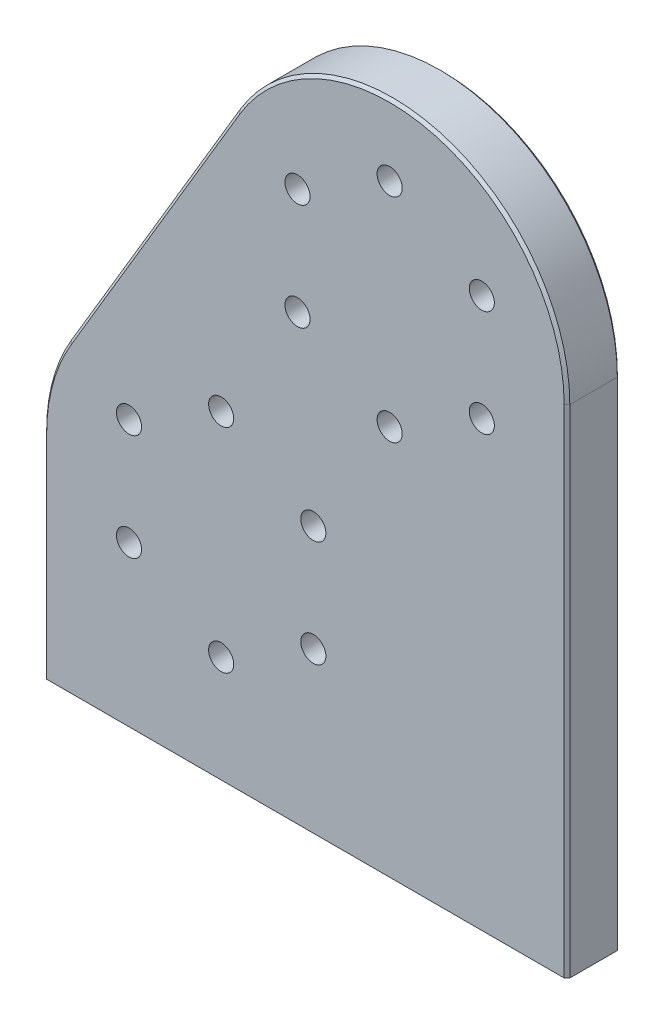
ISO-10303-21;
HEADER;
FILE_DESCRIPTION(('STEP AP214'),'2;1');
FILE_NAME('part.step','',(''),(''),'','','');
FILE_SCHEMA(('AUTOMOTIVE_DESIGN { 1 0 10303 214 1 1 1 1 }'));
ENDSEC;
DATA;
#1=APPLICATION_CONTEXT('core data for automotive mechanical design processes');
#2=APPLICATION_PROTOCOL_DEFINITION('international standard','automotive_design',2000,#1);
#3=PRODUCT_CONTEXT('',#1,'mechanical');
#4=PRODUCT('Part','Part','',(#3));
#5=PRODUCT_RELATED_PRODUCT_CATEGORY('part','',(#4));
#6=PRODUCT_DEFINITION_FORMATION('','',#4);
#7=PRODUCT_DEFINITION_CONTEXT('part definition',#1,'design');
#8=PRODUCT_DEFINITION('design','',#6,#7);
#9=PRODUCT_DEFINITION_SHAPE('','',#8);
#10=(LENGTH_UNIT() NAMED_UNIT(*) SI_UNIT(.MILLI.,.METRE.));
#11=(NAMED_UNIT(*) PLANE_ANGLE_UNIT() SI_UNIT($,.RADIAN.));
#12=(NAMED_UNIT(*) SI_UNIT($,.STERADIAN.) SOLID_ANGLE_UNIT());
#13=UNCERTAINTY_MEASURE_WITH_UNIT(LENGTH_MEASURE(1.E-05),#10,'distance_accuracy_value','');
#14=(GEOMETRIC_REPRESENTATION_CONTEXT(3) GLOBAL_UNCERTAINTY_ASSIGNED_CONTEXT((#13)) GLOBAL_UNIT_ASSIGNED_CONTEXT((#10,
#11,#12)) REPRESENTATION_CONTEXT('',''));
#15=CARTESIAN_POINT('',(0.,0.,0.));
#16=DIRECTION('',(0.,0.,1.));
#17=DIRECTION('',(1.,0.,0.));
#18=AXIS2_PLACEMENT_3D('',#15,#16,#17);
#19=CARTESIAN_POINT('',(30.1625,88.9,4.7625));
#20=DIRECTION('',(0.,0.,-1.));
#21=DIRECTION('',(-1.,0.,0.));
#22=AXIS2_PLACEMENT_3D('',#19,#20,#21);
#23=CYLINDRICAL_SURFACE('',#22,31.75);
#24=DIRECTION('',(0.,0.,-1.));
#25=VECTOR('',#24,1.);
#26=CARTESIAN_POINT('',(2.86211188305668,105.109605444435,4.7625));
#27=LINE('',#26,#25);
#28=CARTESIAN_POINT('',(2.86211188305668,105.109605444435,4.25449999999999));
#29=VERTEX_POINT('',#28);
#30=CARTESIAN_POINT('',(2.86211188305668,105.109605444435,-4.2545));
#31=VERTEX_POINT('',#30);
#32=EDGE_CURVE('E187',#29,#31,#27,.T.);
#33=ORIENTED_EDGE('',*,*,#32,.F.);
#34=CARTESIAN_POINT('',(30.1625,88.9,4.25449999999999));
#35=DIRECTION('',(0.,0.,1.));
#36=DIRECTION('',(1.,0.,0.));
#37=AXIS2_PLACEMENT_3D('',#34,#35,#36);
#38=CIRCLE('',#37,31.75);
#39=CARTESIAN_POINT('',(61.9125,88.9,4.25449999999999));
#40=VERTEX_POINT('',#39);
#41=EDGE_CURVE('E216',#29,#40,#38,.F.);
#42=ORIENTED_EDGE('',*,*,#41,.T.);
#43=DIRECTION('',(0.,0.,-1.));
#44=VECTOR('',#43,1.);
#45=CARTESIAN_POINT('',(61.9125,88.9,4.7625));
#46=LINE('',#45,#44);
#47=CARTESIAN_POINT('',(61.9125,88.9,-4.2545));
#48=VERTEX_POINT('',#47);
#49=EDGE_CURVE('E172',#40,#48,#46,.T.);
#50=ORIENTED_EDGE('',*,*,#49,.T.);
#51=CARTESIAN_POINT('',(30.1625,88.9,-4.25450000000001));
#52=DIRECTION('',(0.,0.,1.));
#53=DIRECTION('',(1.,0.,0.));
#54=AXIS2_PLACEMENT_3D('',#51,#52,#53);
#55=CIRCLE('',#54,31.75);
#56=EDGE_CURVE('E214',#48,#31,#55,.T.);
#57=ORIENTED_EDGE('',*,*,#56,.T.);
#58=EDGE_LOOP('',(#33,#42,#50,#57));
#59=FACE_BOUND('',#58,.T.);
#60=ADVANCED_FACE('F36',(#59),#23,.T.);
#61=CARTESIAN_POINT('',(-27.3003881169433,54.3096054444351,4.7625));
#62=DIRECTION('',(0.859854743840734,-0.510538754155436,0.));
#63=DIRECTION('',(0.510538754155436,0.859854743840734,0.));
#64=AXIS2_PLACEMENT_3D('',#61,#62,#63);
#65=PLANE('',#64);
#66=DIRECTION('',(0.,0.,-1.));
#67=VECTOR('',#66,1.);
#68=CARTESIAN_POINT('',(-27.3003881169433,54.3096054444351,4.7625));
#69=LINE('',#68,#67);
#70=CARTESIAN_POINT('',(-27.3003881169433,54.3096054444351,4.25449999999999));
#71=VERTEX_POINT('',#70);
#72=CARTESIAN_POINT('',(-27.3003881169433,54.3096054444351,-4.2545));
#73=VERTEX_POINT('',#72);
#74=EDGE_CURVE('E184',#71,#73,#69,.T.);
#75=ORIENTED_EDGE('',*,*,#74,.F.);
#76=DIRECTION('',(0.510538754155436,0.859854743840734,0.));
#77=VECTOR('',#76,1.);
#78=CARTESIAN_POINT('',(2.86211188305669,105.109605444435,4.25449999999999));
#79=LINE('',#78,#77);
#80=EDGE_CURVE('E220',#71,#29,#79,.T.);
#81=ORIENTED_EDGE('',*,*,#80,.T.);
#82=ORIENTED_EDGE('',*,*,#32,.T.);
#83=DIRECTION('',(-0.510538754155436,-0.859854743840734,0.));
#84=VECTOR('',#83,1.);
#85=CARTESIAN_POINT('',(-27.3003881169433,54.3096054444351,-4.25450000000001));
#86=LINE('',#85,#84);
#87=EDGE_CURVE('E218',#31,#73,#86,.T.);
#88=ORIENTED_EDGE('',*,*,#87,.T.);
#89=EDGE_LOOP('',(#75,#81,#82,#88));
#90=FACE_BOUND('',#89,.T.);
#91=ADVANCED_FACE('F288',(#90),#65,.F.);
#92=CARTESIAN_POINT('',(0.,38.1,4.7625));
#93=DIRECTION('',(0.,0.,-1.));
#94=DIRECTION('',(-1.,0.,0.));
#95=AXIS2_PLACEMENT_3D('',#92,#93,#94);
#96=CYLINDRICAL_SURFACE('',#95,31.75);
#97=DIRECTION('',(0.,0.,-1.));
#98=VECTOR('',#97,1.);
#99=CARTESIAN_POINT('',(-31.75,38.1,4.7625));
#100=LINE('',#99,#98);
#101=CARTESIAN_POINT('',(-31.75,38.1,4.25449999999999));
#102=VERTEX_POINT('',#101);
#103=CARTESIAN_POINT('',(-31.75,38.1,-4.2545));
#104=VERTEX_POINT('',#103);
#105=EDGE_CURVE('E181',#102,#104,#100,.T.);
#106=ORIENTED_EDGE('',*,*,#105,.F.);
#107=CARTESIAN_POINT('',(0.,38.1,4.25449999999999));
#108=DIRECTION('',(0.,0.,1.));
#109=DIRECTION('',(1.,0.,0.));
#110=AXIS2_PLACEMENT_3D('',#107,#108,#109);
#111=CIRCLE('',#110,31.75);
#112=EDGE_CURVE('E224',#102,#71,#111,.F.);
#113=ORIENTED_EDGE('',*,*,#112,.T.);
#114=ORIENTED_EDGE('',*,*,#74,.T.);
#115=CARTESIAN_POINT('',(0.,38.1,-4.25450000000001));
#116=DIRECTION('',(0.,0.,1.));
#117=DIRECTION('',(1.,0.,0.));
#118=AXIS2_PLACEMENT_3D('',#115,#116,#117);
#119=CIRCLE('',#118,31.75);
#120=EDGE_CURVE('E222',#73,#104,#119,.T.);
#121=ORIENTED_EDGE('',*,*,#120,.T.);
#122=EDGE_LOOP('',(#106,#113,#114,#121));
#123=FACE_BOUND('',#122,.T.);
#124=ADVANCED_FACE('F284',(#123),#96,.T.);
#125=CARTESIAN_POINT('',(-31.75,38.1,4.7625));
#126=DIRECTION('',(1.,0.,0.));
#127=DIRECTION('',(0.,0.,-1.));
#128=AXIS2_PLACEMENT_3D('',#125,#126,#127);
#129=PLANE('',#128);
#130=DIRECTION('',(0.,0.,-1.));
#131=VECTOR('',#130,1.);
#132=CARTESIAN_POINT('',(-31.75,0.,4.7625));
#133=LINE('',#132,#131);
#134=CARTESIAN_POINT('',(-31.75,0.,4.25449999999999));
#135=VERTEX_POINT('',#134);
#136=CARTESIAN_POINT('',(-31.75,0.,-4.25450000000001));
#137=VERTEX_POINT('',#136);
#138=EDGE_CURVE('E178',#135,#137,#133,.T.);
#139=ORIENTED_EDGE('',*,*,#138,.F.);
#140=DIRECTION('',(0.,1.,0.));
#141=VECTOR('',#140,1.);
#142=CARTESIAN_POINT('',(-31.75,38.1,4.25449999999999));
#143=LINE('',#142,#141);
#144=EDGE_CURVE('E228',#135,#102,#143,.T.);
#145=ORIENTED_EDGE('',*,*,#144,.T.);
#146=ORIENTED_EDGE('',*,*,#105,.T.);
#147=DIRECTION('',(0.,-1.,0.));
#148=VECTOR('',#147,1.);
#149=CARTESIAN_POINT('',(-31.75,38.1,-4.25450000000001));
#150=LINE('',#149,#148);
#151=EDGE_CURVE('E226',#104,#137,#150,.T.);
#152=ORIENTED_EDGE('',*,*,#151,.T.);
#153=EDGE_LOOP('',(#139,#145,#146,#152));
#154=FACE_BOUND('',#153,.T.);
#155=ADVANCED_FACE('F269',(#154),#129,.F.);
#156=CARTESIAN_POINT('',(-31.75,0.,4.7625));
#157=DIRECTION('',(0.,1.,0.));
#158=DIRECTION('',(0.,0.,1.));
#159=AXIS2_PLACEMENT_3D('',#156,#157,#158);
#160=PLANE('',#159);
#161=CARTESIAN_POINT('',(50.8,0.,0.));
#162=DIRECTION('',(0.,-1.,0.));
#163=DIRECTION('',(0.,0.,-1.));
#164=AXIS2_PLACEMENT_3D('',#161,#162,#163);
#165=CIRCLE('',#164,2.38125);
#166=CARTESIAN_POINT('',(50.8,0.,-2.38125));
#167=VERTEX_POINT('',#166);
#168=EDGE_CURVE('E247',#167,#167,#165,.T.);
#169=ORIENTED_EDGE('',*,*,#168,.F.);
#170=EDGE_LOOP('',(#169));
#171=FACE_BOUND('',#170,.T.);
#172=CARTESIAN_POINT('',(0.,0.,0.));
#173=DIRECTION('',(0.,-1.,0.));
#174=DIRECTION('',(0.,0.,-1.));
#175=AXIS2_PLACEMENT_3D('',#172,#173,#174);
#176=CIRCLE('',#175,2.38125);
#177=CARTESIAN_POINT('',(0.,0.,-2.38125));
#178=VERTEX_POINT('',#177);
#179=EDGE_CURVE('E625',#178,#178,#176,.T.);
#180=ORIENTED_EDGE('',*,*,#179,.F.);
#181=EDGE_LOOP('',(#180));
#182=FACE_BOUND('',#181,.T.);
#183=CARTESIAN_POINT('',(25.4,0.,0.));
#184=DIRECTION('',(0.,-1.,0.));
#185=DIRECTION('',(0.,0.,-1.));
#186=AXIS2_PLACEMENT_3D('',#183,#184,#185);
#187=CIRCLE('',#186,2.0828);
#188=CARTESIAN_POINT('',(25.4,0.,-2.0828));
#189=VERTEX_POINT('',#188);
#190=EDGE_CURVE('E151',#189,#189,#187,.T.);
#191=ORIENTED_EDGE('',*,*,#190,.F.);
#192=EDGE_LOOP('',(#191));
#193=FACE_BOUND('',#192,.T.);
#194=CARTESIAN_POINT('',(-25.4,0.,0.));
#195=DIRECTION('',(0.,-1.,0.));
#196=DIRECTION('',(0.,0.,-1.));
#197=AXIS2_PLACEMENT_3D('',#194,#195,#196);
#198=CIRCLE('',#197,2.0828);
#199=CARTESIAN_POINT('',(-25.4,0.,-2.0828));
#200=VERTEX_POINT('',#199);
#201=EDGE_CURVE('E163',#200,#200,#198,.T.);
#202=ORIENTED_EDGE('',*,*,#201,.F.);
#203=EDGE_LOOP('',(#202));
#204=FACE_BOUND('',#203,.T.);
#205=DIRECTION('',(0.,0.,-1.));
#206=VECTOR('',#205,1.);
#207=CARTESIAN_POINT('',(61.9125,0.,4.7625));
#208=LINE('',#207,#206);
#209=CARTESIAN_POINT('',(61.9125,0.,4.25449999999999));
#210=VERTEX_POINT('',#209);
#211=CARTESIAN_POINT('',(61.9125,0.,-4.2545));
#212=VERTEX_POINT('',#211);
#213=EDGE_CURVE('E175',#210,#212,#208,.T.);
#214=ORIENTED_EDGE('',*,*,#213,.F.);
#215=DIRECTION('',(-0.707106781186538,0.,0.707106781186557));
#216=VECTOR('',#215,1.);
#217=CARTESIAN_POINT('',(61.4045,0.,4.76250000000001));
#218=LINE('',#217,#216);
#219=CARTESIAN_POINT('',(61.4045,0.,4.7625));
#220=VERTEX_POINT('',#219);
#221=EDGE_CURVE('E212',#210,#220,#218,.T.);
#222=ORIENTED_EDGE('',*,*,#221,.T.);
#223=DIRECTION('',(1.,0.,0.));
#224=VECTOR('',#223,1.);
#225=CARTESIAN_POINT('',(-31.75,0.,4.7625));
#226=LINE('',#225,#224);
#227=CARTESIAN_POINT('',(-31.242,0.,4.7625));
#228=VERTEX_POINT('',#227);
#229=EDGE_CURVE('E169',#228,#220,#226,.T.);
#230=ORIENTED_EDGE('',*,*,#229,.F.);
#231=DIRECTION('',(-0.707106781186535,0.,-0.70710678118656));
#232=VECTOR('',#231,1.);
#233=CARTESIAN_POINT('',(-31.242,0.,4.7625));
#234=LINE('',#233,#232);
#235=EDGE_CURVE('E210',#228,#135,#234,.T.);
#236=ORIENTED_EDGE('',*,*,#235,.T.);
#237=ORIENTED_EDGE('',*,*,#138,.T.);
#238=DIRECTION('',(-0.707106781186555,0.,0.70710678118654));
#239=VECTOR('',#238,1.);
#240=CARTESIAN_POINT('',(-31.75,0.,-4.25450000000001));
#241=LINE('',#240,#239);
#242=CARTESIAN_POINT('',(-31.242,0.,-4.7625));
#243=VERTEX_POINT('',#242);
#244=EDGE_CURVE('E206',#137,#243,#241,.F.);
#245=ORIENTED_EDGE('',*,*,#244,.T.);
#246=DIRECTION('',(1.,0.,0.));
#247=VECTOR('',#246,1.);
#248=CARTESIAN_POINT('',(-31.75,0.,-4.7625));
#249=LINE('',#248,#247);
#250=CARTESIAN_POINT('',(61.4045,0.,-4.76250000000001));
#251=VERTEX_POINT('',#250);
#252=EDGE_CURVE('E166',#243,#251,#249,.T.);
#253=ORIENTED_EDGE('',*,*,#252,.T.);
#254=DIRECTION('',(-0.707106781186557,0.,-0.707106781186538));
#255=VECTOR('',#254,1.);
#256=CARTESIAN_POINT('',(61.9125,0.,-4.25450000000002));
#257=LINE('',#256,#255);
#258=EDGE_CURVE('E208',#251,#212,#257,.F.);
#259=ORIENTED_EDGE('',*,*,#258,.T.);
#260=EDGE_LOOP('',(#214,#222,#230,#236,#237,#245,#253,#259));
#261=FACE_BOUND('',#260,.T.);
#262=ADVANCED_FACE('F274',(#171,#182,#193,#204,#261),#160,.F.);
#263=CARTESIAN_POINT('',(61.9125,88.9,4.7625));
#264=DIRECTION('',(-1.,0.,0.));
#265=DIRECTION('',(0.,-1.,0.));
#266=AXIS2_PLACEMENT_3D('',#263,#264,#265);
#267=PLANE('',#266);
#268=ORIENTED_EDGE('',*,*,#49,.F.);
#269=DIRECTION('',(0.,-1.,0.));
#270=VECTOR('',#269,1.);
#271=CARTESIAN_POINT('',(61.9125,0.,4.25449999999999));
#272=LINE('',#271,#270);
#273=EDGE_CURVE('E204',#40,#210,#272,.T.);
#274=ORIENTED_EDGE('',*,*,#273,.T.);
#275=ORIENTED_EDGE('',*,*,#213,.T.);
#276=DIRECTION('',(0.,1.,0.));
#277=VECTOR('',#276,1.);
#278=CARTESIAN_POINT('',(61.9125,88.9,-4.25450000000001));
#279=LINE('',#278,#277);
#280=EDGE_CURVE('E201',#212,#48,#279,.T.);
#281=ORIENTED_EDGE('',*,*,#280,.T.);
#282=EDGE_LOOP('',(#268,#274,#275,#281));
#283=FACE_BOUND('',#282,.T.);
#284=ADVANCED_FACE('F307',(#283),#267,.F.);
#285=CARTESIAN_POINT('',(30.1625,88.9,4.7625));
#286=DIRECTION('',(0.,0.,1.));
#287=DIRECTION('',(1.,0.,0.));
#288=AXIS2_PLACEMENT_3D('',#285,#286,#287);
#289=PLANE('',#288);
#290=CARTESIAN_POINT('',(30.1625,69.85,4.7625));
#291=DIRECTION('',(0.,0.,1.));
#292=DIRECTION('',(1.,0.,0.));
#293=AXIS2_PLACEMENT_3D('',#290,#291,#292);
#294=CIRCLE('',#293,2.24789999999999);
#295=CARTESIAN_POINT('',(32.4104,69.85,4.7625));
#296=VERTEX_POINT('',#295);
#297=EDGE_CURVE('E644',#296,#296,#294,.T.);
#298=ORIENTED_EDGE('',*,*,#297,.F.);
#299=EDGE_LOOP('',(#298));
#300=FACE_BOUND('',#299,.T.);
#301=CARTESIAN_POINT('',(13.6647160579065,79.375,4.7625));
#302=DIRECTION('',(0.,0.,1.));
#303=DIRECTION('',(1.,0.,0.));
#304=AXIS2_PLACEMENT_3D('',#301,#302,#303);
#305=CIRCLE('',#304,2.24789999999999);
#306=CARTESIAN_POINT('',(15.9126160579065,79.375,4.7625));
#307=VERTEX_POINT('',#306);
#308=EDGE_CURVE('E650',#307,#307,#305,.T.);
#309=ORIENTED_EDGE('',*,*,#308,.F.);
#310=EDGE_LOOP('',(#309));
#311=FACE_BOUND('',#310,.T.);
#312=CARTESIAN_POINT('',(46.6602839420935,98.425,4.7625));
#313=DIRECTION('',(0.,0.,1.));
#314=DIRECTION('',(1.,0.,0.));
#315=AXIS2_PLACEMENT_3D('',#312,#313,#314);
#316=CIRCLE('',#315,2.24789999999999);
#317=CARTESIAN_POINT('',(48.9081839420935,98.425,4.7625));
#318=VERTEX_POINT('',#317);
#319=EDGE_CURVE('E656',#318,#318,#316,.T.);
#320=ORIENTED_EDGE('',*,*,#319,.F.);
#321=EDGE_LOOP('',(#320));
#322=FACE_BOUND('',#321,.T.);
#323=CARTESIAN_POINT('',(30.1625,107.95,4.7625));
#324=DIRECTION('',(0.,0.,1.));
#325=DIRECTION('',(1.,0.,0.));
#326=AXIS2_PLACEMENT_3D('',#323,#324,#325);
#327=CIRCLE('',#326,2.24789999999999);
#328=CARTESIAN_POINT('',(32.4104,107.95,4.7625));
#329=VERTEX_POINT('',#328);
#330=EDGE_CURVE('E662',#329,#329,#327,.T.);
#331=ORIENTED_EDGE('',*,*,#330,.F.);
#332=EDGE_LOOP('',(#331));
#333=FACE_BOUND('',#332,.T.);
#334=CARTESIAN_POINT('',(13.6647160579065,98.425,4.7625));
#335=DIRECTION('',(0.,0.,1.));
#336=DIRECTION('',(1.,0.,0.));
#337=AXIS2_PLACEMENT_3D('',#334,#335,#336);
#338=CIRCLE('',#337,2.24789999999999);
#339=CARTESIAN_POINT('',(15.9126160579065,98.425,4.7625));
#340=VERTEX_POINT('',#339);
#341=EDGE_CURVE('E668',#340,#340,#338,.T.);
#342=ORIENTED_EDGE('',*,*,#341,.F.);
#343=EDGE_LOOP('',(#342));
#344=FACE_BOUND('',#343,.T.);
#345=CARTESIAN_POINT('',(46.6602839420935,79.375,4.7625));
#346=DIRECTION('',(0.,0.,1.));
#347=DIRECTION('',(1.,0.,0.));
#348=AXIS2_PLACEMENT_3D('',#345,#346,#347);
#349=CIRCLE('',#348,2.24789999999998);
#350=CARTESIAN_POINT('',(48.9081839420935,79.375,4.7625));
#351=VERTEX_POINT('',#350);
#352=EDGE_CURVE('E674',#351,#351,#349,.T.);
#353=ORIENTED_EDGE('',*,*,#352,.F.);
#354=EDGE_LOOP('',(#353));
#355=FACE_BOUND('',#354,.T.);
#356=CARTESIAN_POINT('',(16.4977839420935,47.625,4.7625));
#357=DIRECTION('',(0.,0.,1.));
#358=DIRECTION('',(1.,0.,0.));
#359=AXIS2_PLACEMENT_3D('',#356,#357,#358);
#360=CIRCLE('',#359,2.24789999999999);
#361=CARTESIAN_POINT('',(18.7456839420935,47.625,4.7625));
#362=VERTEX_POINT('',#361);
#363=EDGE_CURVE('E680',#362,#362,#360,.T.);
#364=ORIENTED_EDGE('',*,*,#363,.F.);
#365=EDGE_LOOP('',(#364));
#366=FACE_BOUND('',#365,.T.);
#367=CARTESIAN_POINT('',(16.4977839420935,28.575,4.7625));
#368=DIRECTION('',(0.,0.,1.));
#369=DIRECTION('',(1.,0.,0.));
#370=AXIS2_PLACEMENT_3D('',#367,#368,#369);
#371=CIRCLE('',#370,2.24789999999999);
#372=CARTESIAN_POINT('',(18.7456839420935,28.575,4.7625));
#373=VERTEX_POINT('',#372);
#374=EDGE_CURVE('E686',#373,#373,#371,.T.);
#375=ORIENTED_EDGE('',*,*,#374,.F.);
#376=EDGE_LOOP('',(#375));
#377=FACE_BOUND('',#376,.T.);
#378=CARTESIAN_POINT('',(0.,57.15,4.7625));
#379=DIRECTION('',(0.,0.,1.));
#380=DIRECTION('',(1.,0.,0.));
#381=AXIS2_PLACEMENT_3D('',#378,#379,#380);
#382=CIRCLE('',#381,2.24789999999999);
#383=CARTESIAN_POINT('',(2.24789999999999,57.15,4.7625));
#384=VERTEX_POINT('',#383);
#385=EDGE_CURVE('E692',#384,#384,#382,.T.);
#386=ORIENTED_EDGE('',*,*,#385,.F.);
#387=EDGE_LOOP('',(#386));
#388=FACE_BOUND('',#387,.T.);
#389=CARTESIAN_POINT('',(-16.4977839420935,28.575,4.7625));
#390=DIRECTION('',(0.,0.,1.));
#391=DIRECTION('',(1.,0.,0.));
#392=AXIS2_PLACEMENT_3D('',#389,#390,#391);
#393=CIRCLE('',#392,2.24789999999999);
#394=CARTESIAN_POINT('',(-14.2498839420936,28.575,4.7625));
#395=VERTEX_POINT('',#394);
#396=EDGE_CURVE('E698',#395,#395,#393,.T.);
#397=ORIENTED_EDGE('',*,*,#396,.F.);
#398=EDGE_LOOP('',(#397));
#399=FACE_BOUND('',#398,.T.);
#400=CARTESIAN_POINT('',(-16.4977839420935,47.625,4.7625));
#401=DIRECTION('',(0.,0.,1.));
#402=DIRECTION('',(1.,0.,0.));
#403=AXIS2_PLACEMENT_3D('',#400,#401,#402);
#404=CIRCLE('',#403,2.24789999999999);
#405=CARTESIAN_POINT('',(-14.2498839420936,47.625,4.7625));
#406=VERTEX_POINT('',#405);
#407=EDGE_CURVE('E704',#406,#406,#404,.T.);
#408=ORIENTED_EDGE('',*,*,#407,.F.);
#409=EDGE_LOOP('',(#408));
#410=FACE_BOUND('',#409,.T.);
#411=CARTESIAN_POINT('',(0.,19.05,4.7625));
#412=DIRECTION('',(0.,0.,1.));
#413=DIRECTION('',(1.,0.,0.));
#414=AXIS2_PLACEMENT_3D('',#411,#412,#413);
#415=CIRCLE('',#414,2.24789999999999);
#416=CARTESIAN_POINT('',(2.24789999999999,19.05,4.7625));
#417=VERTEX_POINT('',#416);
#418=EDGE_CURVE('E139',#417,#417,#415,.T.);
#419=ORIENTED_EDGE('',*,*,#418,.F.);
#420=EDGE_LOOP('',(#419));
#421=FACE_BOUND('',#420,.T.);
#422=ORIENTED_EDGE('',*,*,#229,.T.);
#423=DIRECTION('',(0.,1.,0.));
#424=VECTOR('',#423,1.);
#425=CARTESIAN_POINT('',(61.4045,88.9,4.7625));
#426=LINE('',#425,#424);
#427=CARTESIAN_POINT('',(61.4045,88.9,4.7625));
#428=VERTEX_POINT('',#427);
#429=EDGE_CURVE('E198',#220,#428,#426,.T.);
#430=ORIENTED_EDGE('',*,*,#429,.T.);
#431=CARTESIAN_POINT('',(30.1625,88.9,4.7625));
#432=DIRECTION('',(0.,0.,1.));
#433=DIRECTION('',(1.,0.,0.));
#434=AXIS2_PLACEMENT_3D('',#431,#432,#433);
#435=CIRCLE('',#434,31.242);
#436=CARTESIAN_POINT('',(3.29891809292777,104.850251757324,4.7625));
#437=VERTEX_POINT('',#436);
#438=EDGE_CURVE('E196',#428,#437,#435,.T.);
#439=ORIENTED_EDGE('',*,*,#438,.T.);
#440=DIRECTION('',(-0.510538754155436,-0.859854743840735,0.));
#441=VECTOR('',#440,1.);
#442=CARTESIAN_POINT('',(-26.8635819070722,54.0502517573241,4.7625));
#443=LINE('',#442,#441);
#444=CARTESIAN_POINT('',(-26.8635819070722,54.0502517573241,4.7625));
#445=VERTEX_POINT('',#444);
#446=EDGE_CURVE('E194',#437,#445,#443,.T.);
#447=ORIENTED_EDGE('',*,*,#446,.T.);
#448=CARTESIAN_POINT('',(0.,38.1,4.7625));
#449=DIRECTION('',(0.,0.,1.));
#450=DIRECTION('',(1.,0.,0.));
#451=AXIS2_PLACEMENT_3D('',#448,#449,#450);
#452=CIRCLE('',#451,31.242);
#453=CARTESIAN_POINT('',(-31.242,38.1,4.7625));
#454=VERTEX_POINT('',#453);
#455=EDGE_CURVE('E192',#445,#454,#452,.T.);
#456=ORIENTED_EDGE('',*,*,#455,.T.);
#457=DIRECTION('',(0.,-1.,0.));
#458=VECTOR('',#457,1.);
#459=CARTESIAN_POINT('',(-31.242,0.,4.7625));
#460=LINE('',#459,#458);
#461=EDGE_CURVE('E190',#454,#228,#460,.T.);
#462=ORIENTED_EDGE('',*,*,#461,.T.);
#463=EDGE_LOOP('',(#422,#430,#439,#447,#456,#462));
#464=FACE_BOUND('',#463,.T.);
#465=ADVANCED_FACE('F314',(#300,#311,#322,#333,#344,#355,#366,#377,#388,#399,#410,#421,#464),
#289,.T.);
#466=CARTESIAN_POINT('',(30.1625,88.9,-4.7625));
#467=DIRECTION('',(0.,0.,1.));
#468=DIRECTION('',(1.,0.,0.));
#469=AXIS2_PLACEMENT_3D('',#466,#467,#468);
#470=PLANE('',#469);
#471=CARTESIAN_POINT('',(30.1625,69.85,-4.7625));
#472=DIRECTION('',(0.,0.,1.));
#473=DIRECTION('',(1.,0.,0.));
#474=AXIS2_PLACEMENT_3D('',#471,#472,#473);
#475=CIRCLE('',#474,2.2479);
#476=CARTESIAN_POINT('',(32.4104,69.85,-4.7625));
#477=VERTEX_POINT('',#476);
#478=EDGE_CURVE('E636',#477,#477,#475,.T.);
#479=ORIENTED_EDGE('',*,*,#478,.T.);
#480=EDGE_LOOP('',(#479));
#481=FACE_BOUND('',#480,.T.);
#482=CARTESIAN_POINT('',(13.6647160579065,79.375,-4.7625));
#483=DIRECTION('',(0.,0.,1.));
#484=DIRECTION('',(1.,0.,0.));
#485=AXIS2_PLACEMENT_3D('',#482,#483,#484);
#486=CIRCLE('',#485,2.2479);
#487=CARTESIAN_POINT('',(15.9126160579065,79.375,-4.7625));
#488=VERTEX_POINT('',#487);
#489=EDGE_CURVE('E647',#488,#488,#486,.T.);
#490=ORIENTED_EDGE('',*,*,#489,.T.);
#491=EDGE_LOOP('',(#490));
#492=FACE_BOUND('',#491,.T.);
#493=CARTESIAN_POINT('',(46.6602839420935,98.425,-4.7625));
#494=DIRECTION('',(0.,0.,1.));
#495=DIRECTION('',(1.,0.,0.));
#496=AXIS2_PLACEMENT_3D('',#493,#494,#495);
#497=CIRCLE('',#496,2.2479);
#498=CARTESIAN_POINT('',(48.9081839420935,98.425,-4.7625));
#499=VERTEX_POINT('',#498);
#500=EDGE_CURVE('E653',#499,#499,#497,.T.);
#501=ORIENTED_EDGE('',*,*,#500,.T.);
#502=EDGE_LOOP('',(#501));
#503=FACE_BOUND('',#502,.T.);
#504=CARTESIAN_POINT('',(30.1625,107.95,-4.7625));
#505=DIRECTION('',(0.,0.,1.));
#506=DIRECTION('',(1.,0.,0.));
#507=AXIS2_PLACEMENT_3D('',#504,#505,#506);
#508=CIRCLE('',#507,2.2479);
#509=CARTESIAN_POINT('',(32.4104,107.95,-4.7625));
#510=VERTEX_POINT('',#509);
#511=EDGE_CURVE('E659',#510,#510,#508,.T.);
#512=ORIENTED_EDGE('',*,*,#511,.T.);
#513=EDGE_LOOP('',(#512));
#514=FACE_BOUND('',#513,.T.);
#515=CARTESIAN_POINT('',(13.6647160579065,98.425,-4.7625));
#516=DIRECTION('',(0.,0.,1.));
#517=DIRECTION('',(1.,0.,0.));
#518=AXIS2_PLACEMENT_3D('',#515,#516,#517);
#519=CIRCLE('',#518,2.2479);
#520=CARTESIAN_POINT('',(15.9126160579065,98.425,-4.7625));
#521=VERTEX_POINT('',#520);
#522=EDGE_CURVE('E665',#521,#521,#519,.T.);
#523=ORIENTED_EDGE('',*,*,#522,.T.);
#524=EDGE_LOOP('',(#523));
#525=FACE_BOUND('',#524,.T.);
#526=CARTESIAN_POINT('',(46.6602839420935,79.375,-4.7625));
#527=DIRECTION('',(0.,0.,1.));
#528=DIRECTION('',(1.,0.,0.));
#529=AXIS2_PLACEMENT_3D('',#526,#527,#528);
#530=CIRCLE('',#529,2.2479);
#531=CARTESIAN_POINT('',(48.9081839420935,79.375,-4.7625));
#532=VERTEX_POINT('',#531);
#533=EDGE_CURVE('E671',#532,#532,#530,.T.);
#534=ORIENTED_EDGE('',*,*,#533,.T.);
#535=EDGE_LOOP('',(#534));
#536=FACE_BOUND('',#535,.T.);
#537=CARTESIAN_POINT('',(16.4977839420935,47.625,-4.7625));
#538=DIRECTION('',(0.,0.,1.));
#539=DIRECTION('',(1.,0.,0.));
#540=AXIS2_PLACEMENT_3D('',#537,#538,#539);
#541=CIRCLE('',#540,2.2479);
#542=CARTESIAN_POINT('',(18.7456839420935,47.625,-4.7625));
#543=VERTEX_POINT('',#542);
#544=EDGE_CURVE('E677',#543,#543,#541,.T.);
#545=ORIENTED_EDGE('',*,*,#544,.T.);
#546=EDGE_LOOP('',(#545));
#547=FACE_BOUND('',#546,.T.);
#548=CARTESIAN_POINT('',(16.4977839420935,28.575,-4.7625));
#549=DIRECTION('',(0.,0.,1.));
#550=DIRECTION('',(1.,0.,0.));
#551=AXIS2_PLACEMENT_3D('',#548,#549,#550);
#552=CIRCLE('',#551,2.2479);
#553=CARTESIAN_POINT('',(18.7456839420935,28.575,-4.7625));
#554=VERTEX_POINT('',#553);
#555=EDGE_CURVE('E683',#554,#554,#552,.T.);
#556=ORIENTED_EDGE('',*,*,#555,.T.);
#557=EDGE_LOOP('',(#556));
#558=FACE_BOUND('',#557,.T.);
#559=CARTESIAN_POINT('',(0.,57.15,-4.7625));
#560=DIRECTION('',(0.,0.,1.));
#561=DIRECTION('',(1.,0.,0.));
#562=AXIS2_PLACEMENT_3D('',#559,#560,#561);
#563=CIRCLE('',#562,2.2479);
#564=CARTESIAN_POINT('',(2.2479,57.15,-4.7625));
#565=VERTEX_POINT('',#564);
#566=EDGE_CURVE('E689',#565,#565,#563,.T.);
#567=ORIENTED_EDGE('',*,*,#566,.T.);
#568=EDGE_LOOP('',(#567));
#569=FACE_BOUND('',#568,.T.);
#570=CARTESIAN_POINT('',(-16.4977839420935,28.575,-4.7625));
#571=DIRECTION('',(0.,0.,1.));
#572=DIRECTION('',(1.,0.,0.));
#573=AXIS2_PLACEMENT_3D('',#570,#571,#572);
#574=CIRCLE('',#573,2.2479);
#575=CARTESIAN_POINT('',(-14.2498839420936,28.575,-4.7625));
#576=VERTEX_POINT('',#575);
#577=EDGE_CURVE('E695',#576,#576,#574,.T.);
#578=ORIENTED_EDGE('',*,*,#577,.T.);
#579=EDGE_LOOP('',(#578));
#580=FACE_BOUND('',#579,.T.);
#581=CARTESIAN_POINT('',(-16.4977839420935,47.625,-4.7625));
#582=DIRECTION('',(0.,0.,1.));
#583=DIRECTION('',(1.,0.,0.));
#584=AXIS2_PLACEMENT_3D('',#581,#582,#583);
#585=CIRCLE('',#584,2.2479);
#586=CARTESIAN_POINT('',(-14.2498839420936,47.625,-4.7625));
#587=VERTEX_POINT('',#586);
#588=EDGE_CURVE('E701',#587,#587,#585,.T.);
#589=ORIENTED_EDGE('',*,*,#588,.T.);
#590=EDGE_LOOP('',(#589));
#591=FACE_BOUND('',#590,.T.);
#592=CARTESIAN_POINT('',(0.,19.05,-4.7625));
#593=DIRECTION('',(0.,0.,1.));
#594=DIRECTION('',(1.,0.,0.));
#595=AXIS2_PLACEMENT_3D('',#592,#593,#594);
#596=CIRCLE('',#595,2.2479);
#597=CARTESIAN_POINT('',(2.2479,19.05,-4.7625));
#598=VERTEX_POINT('',#597);
#599=EDGE_CURVE('E145',#598,#598,#596,.T.);
#600=ORIENTED_EDGE('',*,*,#599,.T.);
#601=EDGE_LOOP('',(#600));
#602=FACE_BOUND('',#601,.T.);
#603=CARTESIAN_POINT('',(30.1625,88.9,-4.7625));
#604=DIRECTION('',(0.,0.,1.));
#605=DIRECTION('',(1.,0.,0.));
#606=AXIS2_PLACEMENT_3D('',#603,#604,#605);
#607=CIRCLE('',#606,31.242);
#608=CARTESIAN_POINT('',(3.29891809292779,104.850251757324,-4.7625));
#609=VERTEX_POINT('',#608);
#610=CARTESIAN_POINT('',(61.4045,88.9,-4.7625));
#611=VERTEX_POINT('',#610);
#612=EDGE_CURVE('E45',#609,#611,#607,.F.);
#613=ORIENTED_EDGE('',*,*,#612,.T.);
#614=DIRECTION('',(0.,-1.,0.));
#615=VECTOR('',#614,1.);
#616=CARTESIAN_POINT('',(61.4045,88.9,-4.7625));
#617=LINE('',#616,#615);
#618=EDGE_CURVE('E11',#611,#251,#617,.T.);
#619=ORIENTED_EDGE('',*,*,#618,.T.);
#620=ORIENTED_EDGE('',*,*,#252,.F.);
#621=DIRECTION('',(0.,1.,0.));
#622=VECTOR('',#621,1.);
#623=CARTESIAN_POINT('',(-31.242,88.9,-4.7625));
#624=LINE('',#623,#622);
#625=CARTESIAN_POINT('',(-31.242,38.1,-4.7625));
#626=VERTEX_POINT('',#625);
#627=EDGE_CURVE('E230',#243,#626,#624,.T.);
#628=ORIENTED_EDGE('',*,*,#627,.T.);
#629=CARTESIAN_POINT('',(0.,38.1,-4.7625));
#630=DIRECTION('',(0.,0.,1.));
#631=DIRECTION('',(1.,0.,0.));
#632=AXIS2_PLACEMENT_3D('',#629,#630,#631);
#633=CIRCLE('',#632,31.242);
#634=CARTESIAN_POINT('',(-26.8635819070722,54.0502517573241,-4.7625));
#635=VERTEX_POINT('',#634);
#636=EDGE_CURVE('E232',#626,#635,#633,.F.);
#637=ORIENTED_EDGE('',*,*,#636,.T.);
#638=DIRECTION('',(0.510538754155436,0.859854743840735,0.));
#639=VECTOR('',#638,1.);
#640=CARTESIAN_POINT('',(3.29891809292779,104.850251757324,-4.7625));
#641=LINE('',#640,#639);
#642=EDGE_CURVE('E56',#635,#609,#641,.T.);
#643=ORIENTED_EDGE('',*,*,#642,.T.);
#644=EDGE_LOOP('',(#613,#619,#620,#628,#637,#643));
#645=FACE_BOUND('',#644,.T.);
#646=ADVANCED_FACE('F316',(#481,#492,#503,#514,#525,#536,#547,#558,#569,#580,#591,#602,#645),
#470,.F.);
#647=CARTESIAN_POINT('',(-25.4,0.,0.));
#648=DIRECTION('',(0.,-1.,0.));
#649=DIRECTION('',(0.,0.,-1.));
#650=AXIS2_PLACEMENT_3D('',#647,#648,#649);
#651=CYLINDRICAL_SURFACE('',#650,2.0828);
#652=CARTESIAN_POINT('',(-25.4,17.78,0.));
#653=DIRECTION('',(0.,-1.,0.));
#654=DIRECTION('',(0.,0.,-1.));
#655=AXIS2_PLACEMENT_3D('',#652,#653,#654);
#656=CIRCLE('',#655,2.0828);
#657=CARTESIAN_POINT('',(-25.4,17.78,-2.0828));
#658=VERTEX_POINT('',#657);
#659=EDGE_CURVE('E160',#658,#658,#656,.T.);
#660=ORIENTED_EDGE('',*,*,#659,.F.);
#661=EDGE_LOOP('',(#660));
#662=FACE_BOUND('',#661,.T.);
#663=ORIENTED_EDGE('',*,*,#201,.T.);
#664=EDGE_LOOP('',(#663));
#665=FACE_BOUND('',#664,.T.);
#666=ADVANCED_FACE('F323',(#662,#665),#651,.F.);
#667=CARTESIAN_POINT('',(-23.6728,17.78,0.));
#668=DIRECTION('',(0.,1.,0.));
#669=DIRECTION('',(0.,0.,1.));
#670=AXIS2_PLACEMENT_3D('',#667,#668,#669);
#671=PLANE('',#670);
#672=CARTESIAN_POINT('',(-25.4,17.78,0.));
#673=DIRECTION('',(0.,-1.,0.));
#674=DIRECTION('',(0.,0.,-1.));
#675=AXIS2_PLACEMENT_3D('',#672,#673,#674);
#676=CIRCLE('',#675,1.72719999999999);
#677=CARTESIAN_POINT('',(-25.4,17.78,-1.72719999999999));
#678=VERTEX_POINT('',#677);
#679=EDGE_CURVE('E157',#678,#678,#676,.T.);
#680=ORIENTED_EDGE('',*,*,#679,.F.);
#681=EDGE_LOOP('',(#680));
#682=FACE_BOUND('',#681,.T.);
#683=ORIENTED_EDGE('',*,*,#659,.T.);
#684=EDGE_LOOP('',(#683));
#685=FACE_BOUND('',#684,.T.);
#686=ADVANCED_FACE('F552',(#682,#685),#671,.F.);
#687=CARTESIAN_POINT('',(-25.4,0.,0.));
#688=DIRECTION('',(0.,-1.,0.));
#689=DIRECTION('',(0.,0.,-1.));
#690=AXIS2_PLACEMENT_3D('',#687,#688,#689);
#691=CYLINDRICAL_SURFACE('',#690,1.72719999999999);
#692=CARTESIAN_POINT('',(-25.4,20.1676,0.));
#693=DIRECTION('',(0.,-1.,0.));
#694=DIRECTION('',(0.,0.,-1.));
#695=AXIS2_PLACEMENT_3D('',#692,#693,#694);
#696=CIRCLE('',#695,1.72719999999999);
#697=CARTESIAN_POINT('',(-25.4,20.1676,-1.72719999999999));
#698=VERTEX_POINT('',#697);
#699=EDGE_CURVE('E154',#698,#698,#696,.T.);
#700=ORIENTED_EDGE('',*,*,#699,.F.);
#701=EDGE_LOOP('',(#700));
#702=FACE_BOUND('',#701,.T.);
#703=ORIENTED_EDGE('',*,*,#679,.T.);
#704=EDGE_LOOP('',(#703));
#705=FACE_BOUND('',#704,.T.);
#706=ADVANCED_FACE('F544',(#702,#705),#691,.F.);
#707=CARTESIAN_POINT('',(-25.4,20.1676,0.));
#708=DIRECTION('',(0.,-1.,0.));
#709=DIRECTION('',(0.,0.,-1.));
#710=AXIS2_PLACEMENT_3D('',#707,#708,#709);
#711=CONICAL_SURFACE('',#710,1.72719999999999,1.02974425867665);
#712=CARTESIAN_POINT('',(-25.4,21.2054064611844,0.));
#713=VERTEX_POINT('',#712);
#714=VERTEX_LOOP('',#713);
#715=FACE_BOUND('',#714,.T.);
#716=ORIENTED_EDGE('',*,*,#699,.T.);
#717=EDGE_LOOP('',(#716));
#718=FACE_BOUND('',#717,.T.);
#719=ADVANCED_FACE('F536',(#715,#718),#711,.F.);
#720=CARTESIAN_POINT('',(25.4,0.,0.));
#721=DIRECTION('',(0.,-1.,0.));
#722=DIRECTION('',(0.,0.,-1.));
#723=AXIS2_PLACEMENT_3D('',#720,#721,#722);
#724=CYLINDRICAL_SURFACE('',#723,2.0828);
#725=CARTESIAN_POINT('',(25.4,17.78,0.));
#726=DIRECTION('',(0.,-1.,0.));
#727=DIRECTION('',(0.,0.,-1.));
#728=AXIS2_PLACEMENT_3D('',#725,#726,#727);
#729=CIRCLE('',#728,2.0828);
#730=CARTESIAN_POINT('',(25.4,17.78,-2.0828));
#731=VERTEX_POINT('',#730);
#732=EDGE_CURVE('E142',#731,#731,#729,.T.);
#733=ORIENTED_EDGE('',*,*,#732,.F.);
#734=EDGE_LOOP('',(#733));
#735=FACE_BOUND('',#734,.T.);
#736=ORIENTED_EDGE('',*,*,#190,.T.);
#737=EDGE_LOOP('',(#736));
#738=FACE_BOUND('',#737,.T.);
#739=ADVANCED_FACE('F528',(#735,#738),#724,.F.);
#740=CARTESIAN_POINT('',(27.1272,17.78,0.));
#741=DIRECTION('',(0.,1.,0.));
#742=DIRECTION('',(0.,0.,1.));
#743=AXIS2_PLACEMENT_3D('',#740,#741,#742);
#744=PLANE('',#743);
#745=CARTESIAN_POINT('',(25.4,17.78,0.));
#746=DIRECTION('',(0.,-1.,0.));
#747=DIRECTION('',(0.,0.,-1.));
#748=AXIS2_PLACEMENT_3D('',#745,#746,#747);
#749=CIRCLE('',#748,1.72719999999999);
#750=CARTESIAN_POINT('',(25.4,17.78,-1.72719999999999));
#751=VERTEX_POINT('',#750);
#752=EDGE_CURVE('E138',#751,#751,#749,.T.);
#753=ORIENTED_EDGE('',*,*,#752,.F.);
#754=EDGE_LOOP('',(#753));
#755=FACE_BOUND('',#754,.T.);
#756=ORIENTED_EDGE('',*,*,#732,.T.);
#757=EDGE_LOOP('',(#756));
#758=FACE_BOUND('',#757,.T.);
#759=ADVANCED_FACE('F521',(#755,#758),#744,.F.);
#760=CARTESIAN_POINT('',(25.4,0.,0.));
#761=DIRECTION('',(0.,-1.,0.));
#762=DIRECTION('',(0.,0.,-1.));
#763=AXIS2_PLACEMENT_3D('',#760,#761,#762);
#764=CYLINDRICAL_SURFACE('',#763,1.72719999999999);
#765=CARTESIAN_POINT('',(25.4,20.1676,0.));
#766=DIRECTION('',(0.,-1.,0.));
#767=DIRECTION('',(0.,0.,-1.));
#768=AXIS2_PLACEMENT_3D('',#765,#766,#767);
#769=CIRCLE('',#768,1.72719999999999);
#770=CARTESIAN_POINT('',(25.4,20.1676,-1.72719999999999));
#771=VERTEX_POINT('',#770);
#772=EDGE_CURVE('E136',#771,#771,#769,.T.);
#773=ORIENTED_EDGE('',*,*,#772,.F.);
#774=EDGE_LOOP('',(#773));
#775=FACE_BOUND('',#774,.T.);
#776=ORIENTED_EDGE('',*,*,#752,.T.);
#777=EDGE_LOOP('',(#776));
#778=FACE_BOUND('',#777,.T.);
#779=ADVANCED_FACE('F132',(#775,#778),#764,.F.);
#780=CARTESIAN_POINT('',(25.4,20.1676,0.));
#781=DIRECTION('',(0.,-1.,0.));
#782=DIRECTION('',(0.,0.,-1.));
#783=AXIS2_PLACEMENT_3D('',#780,#781,#782);
#784=CONICAL_SURFACE('',#783,1.72719999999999,1.02974425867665);
#785=CARTESIAN_POINT('',(25.4,21.2054064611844,0.));
#786=VERTEX_POINT('',#785);
#787=VERTEX_LOOP('',#786);
#788=FACE_BOUND('',#787,.T.);
#789=ORIENTED_EDGE('',*,*,#772,.T.);
#790=EDGE_LOOP('',(#789));
#791=FACE_BOUND('',#790,.T.);
#792=ADVANCED_FACE('F128',(#788,#791),#784,.F.);
#793=CARTESIAN_POINT('',(0.,19.05,4.7625));
#794=DIRECTION('',(0.,0.,1.));
#795=DIRECTION('',(1.,0.,0.));
#796=AXIS2_PLACEMENT_3D('',#793,#794,#795);
#797=CYLINDRICAL_SURFACE('',#796,2.24789999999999);
#798=ORIENTED_EDGE('',*,*,#599,.F.);
#799=EDGE_LOOP('',(#798));
#800=FACE_BOUND('',#799,.T.);
#801=ORIENTED_EDGE('',*,*,#418,.T.);
#802=EDGE_LOOP('',(#801));
#803=FACE_BOUND('',#802,.T.);
#804=ADVANCED_FACE('F131',(#800,#803),#797,.F.);
#805=CARTESIAN_POINT('',(-16.4977839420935,47.625,4.7625));
#806=DIRECTION('',(0.,0.,1.));
#807=DIRECTION('',(1.,0.,0.));
#808=AXIS2_PLACEMENT_3D('',#805,#806,#807);
#809=CYLINDRICAL_SURFACE('',#808,2.24789999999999);
#810=ORIENTED_EDGE('',*,*,#588,.F.);
#811=EDGE_LOOP('',(#810));
#812=FACE_BOUND('',#811,.T.);
#813=ORIENTED_EDGE('',*,*,#407,.T.);
#814=EDGE_LOOP('',(#813));
#815=FACE_BOUND('',#814,.T.);
#816=ADVANCED_FACE('F495',(#812,#815),#809,.F.);
#817=CARTESIAN_POINT('',(-16.4977839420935,28.575,4.7625));
#818=DIRECTION('',(0.,0.,1.));
#819=DIRECTION('',(1.,0.,0.));
#820=AXIS2_PLACEMENT_3D('',#817,#818,#819);
#821=CYLINDRICAL_SURFACE('',#820,2.24789999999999);
#822=ORIENTED_EDGE('',*,*,#577,.F.);
#823=EDGE_LOOP('',(#822));
#824=FACE_BOUND('',#823,.T.);
#825=ORIENTED_EDGE('',*,*,#396,.T.);
#826=EDGE_LOOP('',(#825));
#827=FACE_BOUND('',#826,.T.);
#828=ADVANCED_FACE('F487',(#824,#827),#821,.F.);
#829=CARTESIAN_POINT('',(0.,57.15,4.7625));
#830=DIRECTION('',(0.,0.,1.));
#831=DIRECTION('',(1.,0.,0.));
#832=AXIS2_PLACEMENT_3D('',#829,#830,#831);
#833=CYLINDRICAL_SURFACE('',#832,2.24789999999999);
#834=ORIENTED_EDGE('',*,*,#566,.F.);
#835=EDGE_LOOP('',(#834));
#836=FACE_BOUND('',#835,.T.);
#837=ORIENTED_EDGE('',*,*,#385,.T.);
#838=EDGE_LOOP('',(#837));
#839=FACE_BOUND('',#838,.T.);
#840=ADVANCED_FACE('F479',(#836,#839),#833,.F.);
#841=CARTESIAN_POINT('',(16.4977839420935,28.575,4.7625));
#842=DIRECTION('',(0.,0.,1.));
#843=DIRECTION('',(1.,0.,0.));
#844=AXIS2_PLACEMENT_3D('',#841,#842,#843);
#845=CYLINDRICAL_SURFACE('',#844,2.24789999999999);
#846=ORIENTED_EDGE('',*,*,#555,.F.);
#847=EDGE_LOOP('',(#846));
#848=FACE_BOUND('',#847,.T.);
#849=ORIENTED_EDGE('',*,*,#374,.T.);
#850=EDGE_LOOP('',(#849));
#851=FACE_BOUND('',#850,.T.);
#852=ADVANCED_FACE('F471',(#848,#851),#845,.F.);
#853=CARTESIAN_POINT('',(16.4977839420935,47.625,4.7625));
#854=DIRECTION('',(0.,0.,1.));
#855=DIRECTION('',(1.,0.,0.));
#856=AXIS2_PLACEMENT_3D('',#853,#854,#855);
#857=CYLINDRICAL_SURFACE('',#856,2.24789999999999);
#858=ORIENTED_EDGE('',*,*,#544,.F.);
#859=EDGE_LOOP('',(#858));
#860=FACE_BOUND('',#859,.T.);
#861=ORIENTED_EDGE('',*,*,#363,.T.);
#862=EDGE_LOOP('',(#861));
#863=FACE_BOUND('',#862,.T.);
#864=ADVANCED_FACE('F463',(#860,#863),#857,.F.);
#865=CARTESIAN_POINT('',(46.6602839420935,79.375,4.7625));
#866=DIRECTION('',(0.,0.,1.));
#867=DIRECTION('',(1.,0.,0.));
#868=AXIS2_PLACEMENT_3D('',#865,#866,#867);
#869=CYLINDRICAL_SURFACE('',#868,2.24789999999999);
#870=ORIENTED_EDGE('',*,*,#533,.F.);
#871=EDGE_LOOP('',(#870));
#872=FACE_BOUND('',#871,.T.);
#873=ORIENTED_EDGE('',*,*,#352,.T.);
#874=EDGE_LOOP('',(#873));
#875=FACE_BOUND('',#874,.T.);
#876=ADVANCED_FACE('F455',(#872,#875),#869,.F.);
#877=CARTESIAN_POINT('',(13.6647160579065,98.425,4.7625));
#878=DIRECTION('',(0.,0.,1.));
#879=DIRECTION('',(1.,0.,0.));
#880=AXIS2_PLACEMENT_3D('',#877,#878,#879);
#881=CYLINDRICAL_SURFACE('',#880,2.24789999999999);
#882=ORIENTED_EDGE('',*,*,#522,.F.);
#883=EDGE_LOOP('',(#882));
#884=FACE_BOUND('',#883,.T.);
#885=ORIENTED_EDGE('',*,*,#341,.T.);
#886=EDGE_LOOP('',(#885));
#887=FACE_BOUND('',#886,.T.);
#888=ADVANCED_FACE('F447',(#884,#887),#881,.F.);
#889=CARTESIAN_POINT('',(30.1625,107.95,4.7625));
#890=DIRECTION('',(0.,0.,1.));
#891=DIRECTION('',(1.,0.,0.));
#892=AXIS2_PLACEMENT_3D('',#889,#890,#891);
#893=CYLINDRICAL_SURFACE('',#892,2.24789999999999);
#894=ORIENTED_EDGE('',*,*,#511,.F.);
#895=EDGE_LOOP('',(#894));
#896=FACE_BOUND('',#895,.T.);
#897=ORIENTED_EDGE('',*,*,#330,.T.);
#898=EDGE_LOOP('',(#897));
#899=FACE_BOUND('',#898,.T.);
#900=ADVANCED_FACE('F439',(#896,#899),#893,.F.);
#901=CARTESIAN_POINT('',(46.6602839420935,98.425,4.7625));
#902=DIRECTION('',(0.,0.,1.));
#903=DIRECTION('',(1.,0.,0.));
#904=AXIS2_PLACEMENT_3D('',#901,#902,#903);
#905=CYLINDRICAL_SURFACE('',#904,2.24789999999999);
#906=ORIENTED_EDGE('',*,*,#500,.F.);
#907=EDGE_LOOP('',(#906));
#908=FACE_BOUND('',#907,.T.);
#909=ORIENTED_EDGE('',*,*,#319,.T.);
#910=EDGE_LOOP('',(#909));
#911=FACE_BOUND('',#910,.T.);
#912=ADVANCED_FACE('F431',(#908,#911),#905,.F.);
#913=CARTESIAN_POINT('',(13.6647160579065,79.375,4.7625));
#914=DIRECTION('',(0.,0.,1.));
#915=DIRECTION('',(1.,0.,0.));
#916=AXIS2_PLACEMENT_3D('',#913,#914,#915);
#917=CYLINDRICAL_SURFACE('',#916,2.24789999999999);
#918=ORIENTED_EDGE('',*,*,#489,.F.);
#919=EDGE_LOOP('',(#918));
#920=FACE_BOUND('',#919,.T.);
#921=ORIENTED_EDGE('',*,*,#308,.T.);
#922=EDGE_LOOP('',(#921));
#923=FACE_BOUND('',#922,.T.);
#924=ADVANCED_FACE('F423',(#920,#923),#917,.F.);
#925=CARTESIAN_POINT('',(30.1625,69.85,4.7625));
#926=DIRECTION('',(0.,0.,1.));
#927=DIRECTION('',(1.,0.,0.));
#928=AXIS2_PLACEMENT_3D('',#925,#926,#927);
#929=CYLINDRICAL_SURFACE('',#928,2.24789999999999);
#930=ORIENTED_EDGE('',*,*,#478,.F.);
#931=EDGE_LOOP('',(#930));
#932=FACE_BOUND('',#931,.T.);
#933=ORIENTED_EDGE('',*,*,#297,.T.);
#934=EDGE_LOOP('',(#933));
#935=FACE_BOUND('',#934,.T.);
#936=ADVANCED_FACE('F415',(#932,#935),#929,.F.);
#937=CARTESIAN_POINT('',(0.,12.7,0.));
#938=DIRECTION('',(0.,-1.,0.));
#939=DIRECTION('',(0.,0.,-1.));
#940=AXIS2_PLACEMENT_3D('',#937,#938,#939);
#941=CYLINDRICAL_SURFACE('',#940,2.38125);
#942=CARTESIAN_POINT('',(0.,12.7,0.));
#943=DIRECTION('',(0.,-1.,0.));
#944=DIRECTION('',(0.,0.,-1.));
#945=AXIS2_PLACEMENT_3D('',#942,#943,#944);
#946=CIRCLE('',#945,2.38125);
#947=CARTESIAN_POINT('',(0.,12.7,-2.38125));
#948=VERTEX_POINT('',#947);
#949=EDGE_CURVE('E632',#948,#948,#946,.T.);
#950=ORIENTED_EDGE('',*,*,#949,.F.);
#951=EDGE_LOOP('',(#950));
#952=FACE_BOUND('',#951,.T.);
#953=ORIENTED_EDGE('',*,*,#179,.T.);
#954=EDGE_LOOP('',(#953));
#955=FACE_BOUND('',#954,.T.);
#956=ADVANCED_FACE('F407',(#952,#955),#941,.F.);
#957=CARTESIAN_POINT('',(0.,12.7,0.));
#958=DIRECTION('',(0.,-1.,0.));
#959=DIRECTION('',(0.,0.,-1.));
#960=AXIS2_PLACEMENT_3D('',#957,#958,#959);
#961=PLANE('',#960);
#962=ORIENTED_EDGE('',*,*,#949,.T.);
#963=EDGE_LOOP('',(#962));
#964=FACE_BOUND('',#963,.T.);
#965=ADVANCED_FACE('F399',(#964),#961,.T.);
#966=CARTESIAN_POINT('',(50.8,12.7,0.));
#967=DIRECTION('',(0.,-1.,0.));
#968=DIRECTION('',(0.,0.,-1.));
#969=AXIS2_PLACEMENT_3D('',#966,#967,#968);
#970=CYLINDRICAL_SURFACE('',#969,2.38125);
#971=CARTESIAN_POINT('',(50.8,12.7,0.));
#972=DIRECTION('',(0.,-1.,0.));
#973=DIRECTION('',(0.,0.,-1.));
#974=AXIS2_PLACEMENT_3D('',#971,#972,#973);
#975=CIRCLE('',#974,2.38125);
#976=CARTESIAN_POINT('',(50.8,12.7,-2.38125));
#977=VERTEX_POINT('',#976);
#978=EDGE_CURVE('E633',#977,#977,#975,.T.);
#979=ORIENTED_EDGE('',*,*,#978,.F.);
#980=EDGE_LOOP('',(#979));
#981=FACE_BOUND('',#980,.T.);
#982=ORIENTED_EDGE('',*,*,#168,.T.);
#983=EDGE_LOOP('',(#982));
#984=FACE_BOUND('',#983,.T.);
#985=ADVANCED_FACE('F391',(#981,#984),#970,.F.);
#986=CARTESIAN_POINT('',(50.8,12.7,0.));
#987=DIRECTION('',(0.,-1.,0.));
#988=DIRECTION('',(0.,0.,-1.));
#989=AXIS2_PLACEMENT_3D('',#986,#987,#988);
#990=PLANE('',#989);
#991=ORIENTED_EDGE('',*,*,#978,.T.);
#992=EDGE_LOOP('',(#991));
#993=FACE_BOUND('',#992,.T.);
#994=ADVANCED_FACE('F347',(#993),#990,.T.);
#995=CARTESIAN_POINT('',(-31.242,88.9,4.7625));
#996=DIRECTION('',(-0.70710678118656,0.,0.707106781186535));
#997=DIRECTION('',(0.707106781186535,0.,0.70710678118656));
#998=AXIS2_PLACEMENT_3D('',#995,#996,#997);
#999=PLANE('',#998);
#1000=ORIENTED_EDGE('',*,*,#235,.F.);
#1001=ORIENTED_EDGE('',*,*,#461,.F.);
#1002=DIRECTION('',(0.707106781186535,0.,0.70710678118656));
#1003=VECTOR('',#1002,1.);
#1004=CARTESIAN_POINT('',(-31.75,38.1,4.25449999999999));
#1005=LINE('',#1004,#1003);
#1006=EDGE_CURVE('E244',#102,#454,#1005,.T.);
#1007=ORIENTED_EDGE('',*,*,#1006,.F.);
#1008=ORIENTED_EDGE('',*,*,#144,.F.);
#1009=EDGE_LOOP('',(#1000,#1001,#1007,#1008));
#1010=FACE_BOUND('',#1009,.T.);
#1011=ADVANCED_FACE('F280',(#1010),#999,.T.);
#1012=CARTESIAN_POINT('',(0.,38.1,4.7625));
#1013=DIRECTION('',(0.,0.,-1.));
#1014=DIRECTION('',(-1.,0.,0.));
#1015=AXIS2_PLACEMENT_3D('',#1012,#1013,#1014);
#1016=CONICAL_SURFACE('',#1015,31.242,0.785398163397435);
#1017=ORIENTED_EDGE('',*,*,#1006,.T.);
#1018=ORIENTED_EDGE('',*,*,#455,.F.);
#1019=DIRECTION('',(0.608009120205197,-0.361005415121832,0.707106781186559));
#1020=VECTOR('',#1019,1.);
#1021=CARTESIAN_POINT('',(-27.3003881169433,54.3096054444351,4.25449999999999));
#1022=LINE('',#1021,#1020);
#1023=EDGE_CURVE('E241',#71,#445,#1022,.T.);
#1024=ORIENTED_EDGE('',*,*,#1023,.F.);
#1025=ORIENTED_EDGE('',*,*,#112,.F.);
#1026=EDGE_LOOP('',(#1017,#1018,#1024,#1025));
#1027=FACE_BOUND('',#1026,.T.);
#1028=ADVANCED_FACE('F293',(#1027),#1016,.T.);
#1029=CARTESIAN_POINT('',(3.29891809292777,104.850251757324,4.7625));
#1030=DIRECTION('',(-0.608009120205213,0.361005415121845,0.707106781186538));
#1031=DIRECTION('',(0.758239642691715,0.,0.651975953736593));
#1032=AXIS2_PLACEMENT_3D('',#1029,#1030,#1031);
#1033=PLANE('',#1032);
#1034=ORIENTED_EDGE('',*,*,#1023,.T.);
#1035=ORIENTED_EDGE('',*,*,#446,.F.);
#1036=DIRECTION('',(0.608009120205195,-0.361005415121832,0.70710678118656));
#1037=VECTOR('',#1036,1.);
#1038=CARTESIAN_POINT('',(2.86211188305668,105.109605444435,4.25449999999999));
#1039=LINE('',#1038,#1037);
#1040=EDGE_CURVE('E238',#29,#437,#1039,.T.);
#1041=ORIENTED_EDGE('',*,*,#1040,.F.);
#1042=ORIENTED_EDGE('',*,*,#80,.F.);
#1043=EDGE_LOOP('',(#1034,#1035,#1041,#1042));
#1044=FACE_BOUND('',#1043,.T.);
#1045=ADVANCED_FACE('F297',(#1044),#1033,.T.);
#1046=CARTESIAN_POINT('',(30.1625,88.9,4.7625));
#1047=DIRECTION('',(0.,0.,-1.));
#1048=DIRECTION('',(-1.,0.,0.));
#1049=AXIS2_PLACEMENT_3D('',#1046,#1047,#1048);
#1050=CONICAL_SURFACE('',#1049,31.242,0.785398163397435);
#1051=ORIENTED_EDGE('',*,*,#1040,.T.);
#1052=ORIENTED_EDGE('',*,*,#438,.F.);
#1053=DIRECTION('',(-0.707106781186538,0.,0.707106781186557));
#1054=VECTOR('',#1053,1.);
#1055=CARTESIAN_POINT('',(61.9125,88.9,4.25449999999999));
#1056=LINE('',#1055,#1054);
#1057=EDGE_CURVE('E236',#40,#428,#1056,.T.);
#1058=ORIENTED_EDGE('',*,*,#1057,.F.);
#1059=ORIENTED_EDGE('',*,*,#41,.F.);
#1060=EDGE_LOOP('',(#1051,#1052,#1058,#1059));
#1061=FACE_BOUND('',#1060,.T.);
#1062=ADVANCED_FACE('F302',(#1061),#1050,.T.);
#1063=CARTESIAN_POINT('',(61.4045,88.9,4.7625));
#1064=DIRECTION('',(0.707106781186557,0.,0.707106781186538));
#1065=DIRECTION('',(0.707106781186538,0.,-0.707106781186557));
#1066=AXIS2_PLACEMENT_3D('',#1063,#1064,#1065);
#1067=PLANE('',#1066);
#1068=ORIENTED_EDGE('',*,*,#221,.F.);
#1069=ORIENTED_EDGE('',*,*,#273,.F.);
#1070=ORIENTED_EDGE('',*,*,#1057,.T.);
#1071=ORIENTED_EDGE('',*,*,#429,.F.);
#1072=EDGE_LOOP('',(#1068,#1069,#1070,#1071));
#1073=FACE_BOUND('',#1072,.T.);
#1074=ADVANCED_FACE('F311',(#1073),#1067,.T.);
#1075=CARTESIAN_POINT('',(-31.75,38.1,-4.25450000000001));
#1076=DIRECTION('',(0.70710678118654,0.,0.707106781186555));
#1077=DIRECTION('',(0.707106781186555,0.,-0.70710678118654));
#1078=AXIS2_PLACEMENT_3D('',#1075,#1076,#1077);
#1079=PLANE('',#1078);
#1080=ORIENTED_EDGE('',*,*,#244,.F.);
#1081=ORIENTED_EDGE('',*,*,#151,.F.);
#1082=DIRECTION('',(-0.707106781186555,0.,0.70710678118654));
#1083=VECTOR('',#1082,1.);
#1084=CARTESIAN_POINT('',(-31.242,38.1,-4.7625));
#1085=LINE('',#1084,#1083);
#1086=EDGE_CURVE('E40',#626,#104,#1085,.T.);
#1087=ORIENTED_EDGE('',*,*,#1086,.F.);
#1088=ORIENTED_EDGE('',*,*,#627,.F.);
#1089=EDGE_LOOP('',(#1080,#1081,#1087,#1088));
#1090=FACE_BOUND('',#1089,.T.);
#1091=ADVANCED_FACE('F38',(#1090),#1079,.F.);
#1092=CARTESIAN_POINT('',(0.,38.1,-4.25450000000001));
#1093=DIRECTION('',(0.,0.,1.));
#1094=DIRECTION('',(1.,0.,0.));
#1095=AXIS2_PLACEMENT_3D('',#1092,#1093,#1094);
#1096=CONICAL_SURFACE('',#1095,31.75,0.785398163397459);
#1097=ORIENTED_EDGE('',*,*,#1086,.T.);
#1098=ORIENTED_EDGE('',*,*,#120,.F.);
#1099=DIRECTION('',(-0.608009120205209,0.361005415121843,0.707106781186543));
#1100=VECTOR('',#1099,1.);
#1101=CARTESIAN_POINT('',(-26.8635819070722,54.0502517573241,-4.7625));
#1102=LINE('',#1101,#1100);
#1103=EDGE_CURVE('E252',#635,#73,#1102,.T.);
#1104=ORIENTED_EDGE('',*,*,#1103,.F.);
#1105=ORIENTED_EDGE('',*,*,#636,.F.);
#1106=EDGE_LOOP('',(#1097,#1098,#1104,#1105));
#1107=FACE_BOUND('',#1106,.T.);
#1108=ADVANCED_FACE('F262',(#1107),#1096,.T.);
#1109=CARTESIAN_POINT('',(-27.3003881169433,54.3096054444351,-4.25450000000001));
#1110=DIRECTION('',(0.608009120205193,-0.361005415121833,0.707106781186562));
#1111=DIRECTION('',(0.758239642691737,0.,-0.651975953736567));
#1112=AXIS2_PLACEMENT_3D('',#1109,#1110,#1111);
#1113=PLANE('',#1112);
#1114=ORIENTED_EDGE('',*,*,#1103,.T.);
#1115=ORIENTED_EDGE('',*,*,#87,.F.);
#1116=DIRECTION('',(-0.608009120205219,0.361005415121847,0.707106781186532));
#1117=VECTOR('',#1116,1.);
#1118=CARTESIAN_POINT('',(3.29891809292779,104.850251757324,-4.7625));
#1119=LINE('',#1118,#1117);
#1120=EDGE_CURVE('E250',#609,#31,#1119,.T.);
#1121=ORIENTED_EDGE('',*,*,#1120,.F.);
#1122=ORIENTED_EDGE('',*,*,#642,.F.);
#1123=EDGE_LOOP('',(#1114,#1115,#1121,#1122));
#1124=FACE_BOUND('',#1123,.T.);
#1125=ADVANCED_FACE('F355',(#1124),#1113,.F.);
#1126=CARTESIAN_POINT('',(30.1625,88.9,-4.25450000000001));
#1127=DIRECTION('',(0.,0.,1.));
#1128=DIRECTION('',(1.,0.,0.));
#1129=AXIS2_PLACEMENT_3D('',#1126,#1127,#1128);
#1130=CONICAL_SURFACE('',#1129,31.75,0.785398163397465);
#1131=ORIENTED_EDGE('',*,*,#1120,.T.);
#1132=ORIENTED_EDGE('',*,*,#56,.F.);
#1133=DIRECTION('',(0.707106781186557,0.,0.707106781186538));
#1134=VECTOR('',#1133,1.);
#1135=CARTESIAN_POINT('',(61.4045,88.9,-4.7625));
#1136=LINE('',#1135,#1134);
#1137=EDGE_CURVE('E248',#611,#48,#1136,.T.);
#1138=ORIENTED_EDGE('',*,*,#1137,.F.);
#1139=ORIENTED_EDGE('',*,*,#612,.F.);
#1140=EDGE_LOOP('',(#1131,#1132,#1138,#1139));
#1141=FACE_BOUND('',#1140,.T.);
#1142=ADVANCED_FACE('F351',(#1141),#1130,.T.);
#1143=CARTESIAN_POINT('',(61.9125,88.9,-4.25450000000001));
#1144=DIRECTION('',(-0.707106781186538,0.,0.707106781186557));
#1145=DIRECTION('',(0.707106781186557,0.,0.707106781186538));
#1146=AXIS2_PLACEMENT_3D('',#1143,#1144,#1145);
#1147=PLANE('',#1146);
#1148=ORIENTED_EDGE('',*,*,#258,.F.);
#1149=ORIENTED_EDGE('',*,*,#618,.F.);
#1150=ORIENTED_EDGE('',*,*,#1137,.T.);
#1151=ORIENTED_EDGE('',*,*,#280,.F.);
#1152=EDGE_LOOP('',(#1148,#1149,#1150,#1151));
#1153=FACE_BOUND('',#1152,.T.);
#1154=ADVANCED_FACE('F348',(#1153),#1147,.F.);
#1155=CLOSED_SHELL('',(#60,#91,#124,#155,#262,#284,#465,#646,#666,#686,#706,#719,#739,#759,#779,
#792,#804,#816,#828,#840,#852,#864,#876,#888,#900,#912,#924,#936,#956,#965,#985,#994,#1011,
#1028,#1045,#1062,#1074,#1091,#1108,#1125,#1142,#1154));
#1156=MANIFOLD_SOLID_BREP('B2',#1155);
#1157=ADVANCED_BREP_SHAPE_REPRESENTATION('',(#18,#1156),#14);
#1158=SHAPE_DEFINITION_REPRESENTATION(#9,#1157);
ENDSEC;
END-ISO-10303-21;
